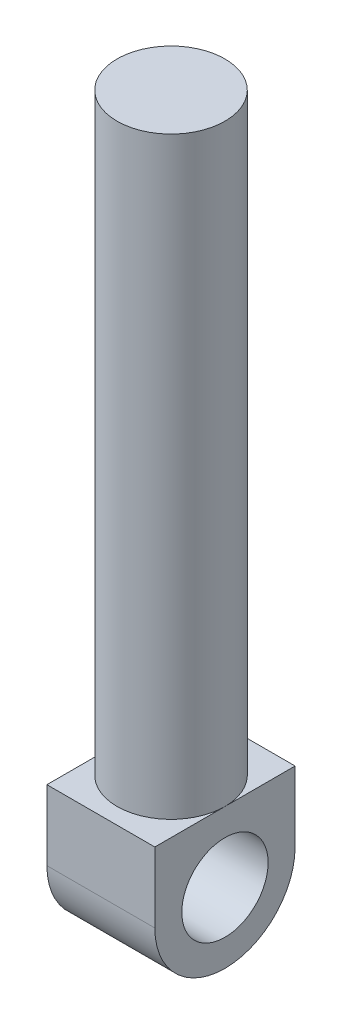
ISO-10303-21;
HEADER;
FILE_DESCRIPTION(('STEP AP214'),'2;1');
FILE_NAME('part.step','',(''),(''),'','','');
FILE_SCHEMA(('AUTOMOTIVE_DESIGN { 1 0 10303 214 1 1 1 1 }'));
ENDSEC;
DATA;
#1=APPLICATION_CONTEXT('core data for automotive mechanical design processes');
#2=APPLICATION_PROTOCOL_DEFINITION('international standard','automotive_design',2000,#1);
#3=PRODUCT_CONTEXT('',#1,'mechanical');
#4=PRODUCT('Part','Part','',(#3));
#5=PRODUCT_RELATED_PRODUCT_CATEGORY('part','',(#4));
#6=PRODUCT_DEFINITION_FORMATION('','',#4);
#7=PRODUCT_DEFINITION_CONTEXT('part definition',#1,'design');
#8=PRODUCT_DEFINITION('design','',#6,#7);
#9=PRODUCT_DEFINITION_SHAPE('','',#8);
#10=(LENGTH_UNIT() NAMED_UNIT(*) SI_UNIT(.MILLI.,.METRE.));
#11=(NAMED_UNIT(*) PLANE_ANGLE_UNIT() SI_UNIT($,.RADIAN.));
#12=(NAMED_UNIT(*) SI_UNIT($,.STERADIAN.) SOLID_ANGLE_UNIT());
#13=UNCERTAINTY_MEASURE_WITH_UNIT(LENGTH_MEASURE(1.E-05),#10,'distance_accuracy_value','');
#14=(GEOMETRIC_REPRESENTATION_CONTEXT(3) GLOBAL_UNCERTAINTY_ASSIGNED_CONTEXT((#13)) GLOBAL_UNIT_ASSIGNED_CONTEXT((#10,
#11,#12)) REPRESENTATION_CONTEXT('',''));
#15=CARTESIAN_POINT('',(0.,0.,0.));
#16=DIRECTION('',(0.,0.,1.));
#17=DIRECTION('',(1.,0.,0.));
#18=AXIS2_PLACEMENT_3D('',#15,#16,#17);
#19=CARTESIAN_POINT('',(0.,615.,0.));
#20=DIRECTION('',(0.,-1.,0.));
#21=DIRECTION('',(0.,0.,-1.));
#22=AXIS2_PLACEMENT_3D('',#19,#20,#21);
#23=CYLINDRICAL_SURFACE('',#22,50.);
#24=CARTESIAN_POINT('',(0.,615.,0.));
#25=DIRECTION('',(0.,1.,0.));
#26=DIRECTION('',(0.,0.,1.));
#27=AXIS2_PLACEMENT_3D('',#24,#25,#26);
#28=CIRCLE('',#27,50.);
#29=CARTESIAN_POINT('',(0.,615.,50.));
#30=VERTEX_POINT('',#29);
#31=EDGE_CURVE('E11',#30,#30,#28,.T.);
#32=ORIENTED_EDGE('',*,*,#31,.F.);
#33=EDGE_LOOP('',(#32));
#34=FACE_BOUND('',#33,.T.);
#35=CARTESIAN_POINT('',(0.,65.,0.));
#36=DIRECTION('',(0.,1.,0.));
#37=DIRECTION('',(0.,0.,1.));
#38=AXIS2_PLACEMENT_3D('',#35,#36,#37);
#39=CIRCLE('',#38,50.);
#40=CARTESIAN_POINT('',(0.,65.,50.));
#41=VERTEX_POINT('',#40);
#42=EDGE_CURVE('E52',#41,#41,#39,.T.);
#43=ORIENTED_EDGE('',*,*,#42,.T.);
#44=EDGE_LOOP('',(#43));
#45=FACE_BOUND('',#44,.T.);
#46=ADVANCED_FACE('F49',(#34,#45),#23,.T.);
#47=CARTESIAN_POINT('',(0.,615.,0.));
#48=DIRECTION('',(0.,1.,0.));
#49=DIRECTION('',(0.,0.,1.));
#50=AXIS2_PLACEMENT_3D('',#47,#48,#49);
#51=PLANE('',#50);
#52=ORIENTED_EDGE('',*,*,#31,.T.);
#53=EDGE_LOOP('',(#52));
#54=FACE_BOUND('',#53,.T.);
#55=ADVANCED_FACE('F64',(#54),#51,.T.);
#56=CARTESIAN_POINT('',(0.,65.,0.));
#57=DIRECTION('',(0.,1.,0.));
#58=DIRECTION('',(0.,0.,1.));
#59=AXIS2_PLACEMENT_3D('',#56,#57,#58);
#60=PLANE('',#59);
#61=ORIENTED_EDGE('',*,*,#42,.F.);
#62=EDGE_LOOP('',(#61));
#63=FACE_BOUND('',#62,.T.);
#64=ADVANCED_FACE('F62',(#63),#60,.F.);
#65=CLOSED_SHELL('',(#46,#55,#64));
#66=MANIFOLD_SOLID_BREP('B2',#65);
#67=CARTESIAN_POINT('',(50.,65.,0.));
#68=DIRECTION('',(0.,1.,0.));
#69=DIRECTION('',(0.,0.,1.));
#70=AXIS2_PLACEMENT_3D('',#67,#68,#69);
#71=PLANE('',#70);
#72=DIRECTION('',(0.,0.,-1.));
#73=VECTOR('',#72,1.);
#74=CARTESIAN_POINT('',(-50.,65.,0.));
#75=LINE('',#74,#73);
#76=CARTESIAN_POINT('',(-50.,65.,65.));
#77=VERTEX_POINT('',#76);
#78=CARTESIAN_POINT('',(-50.,65.,-65.));
#79=VERTEX_POINT('',#78);
#80=EDGE_CURVE('E164',#77,#79,#75,.T.);
#81=ORIENTED_EDGE('',*,*,#80,.F.);
#82=DIRECTION('',(-1.,0.,0.));
#83=VECTOR('',#82,1.);
#84=CARTESIAN_POINT('',(50.,65.,65.));
#85=LINE('',#84,#83);
#86=CARTESIAN_POINT('',(50.,65.,65.));
#87=VERTEX_POINT('',#86);
#88=EDGE_CURVE('E47',#87,#77,#85,.T.);
#89=ORIENTED_EDGE('',*,*,#88,.F.);
#90=DIRECTION('',(0.,0.,-1.));
#91=VECTOR('',#90,1.);
#92=CARTESIAN_POINT('',(50.,65.,0.));
#93=LINE('',#92,#91);
#94=CARTESIAN_POINT('',(50.,65.,-65.));
#95=VERTEX_POINT('',#94);
#96=EDGE_CURVE('E155',#87,#95,#93,.T.);
#97=ORIENTED_EDGE('',*,*,#96,.T.);
#98=DIRECTION('',(-1.,0.,0.));
#99=VECTOR('',#98,1.);
#100=CARTESIAN_POINT('',(50.,65.,-65.));
#101=LINE('',#100,#99);
#102=EDGE_CURVE('E112',#95,#79,#101,.T.);
#103=ORIENTED_EDGE('',*,*,#102,.T.);
#104=EDGE_LOOP('',(#81,#89,#97,#103));
#105=FACE_BOUND('',#104,.T.);
#106=ADVANCED_FACE('F96',(#105),#71,.T.);
#107=CARTESIAN_POINT('',(50.,0.,65.));
#108=DIRECTION('',(0.,0.,1.));
#109=DIRECTION('',(0.,-1.,0.));
#110=AXIS2_PLACEMENT_3D('',#107,#108,#109);
#111=PLANE('',#110);
#112=DIRECTION('',(0.,1.,0.));
#113=VECTOR('',#112,1.);
#114=CARTESIAN_POINT('',(-50.,0.,65.));
#115=LINE('',#114,#113);
#116=CARTESIAN_POINT('',(-50.,0.,65.));
#117=VERTEX_POINT('',#116);
#118=EDGE_CURVE('E144',#117,#77,#115,.T.);
#119=ORIENTED_EDGE('',*,*,#118,.F.);
#120=DIRECTION('',(-1.,0.,0.));
#121=VECTOR('',#120,1.);
#122=CARTESIAN_POINT('',(50.,0.,65.));
#123=LINE('',#122,#121);
#124=CARTESIAN_POINT('',(50.,0.,65.));
#125=VERTEX_POINT('',#124);
#126=EDGE_CURVE('E104',#125,#117,#123,.T.);
#127=ORIENTED_EDGE('',*,*,#126,.F.);
#128=DIRECTION('',(0.,1.,0.));
#129=VECTOR('',#128,1.);
#130=CARTESIAN_POINT('',(50.,0.,65.));
#131=LINE('',#130,#129);
#132=EDGE_CURVE('E142',#125,#87,#131,.T.);
#133=ORIENTED_EDGE('',*,*,#132,.T.);
#134=ORIENTED_EDGE('',*,*,#88,.T.);
#135=EDGE_LOOP('',(#119,#127,#133,#134));
#136=FACE_BOUND('',#135,.T.);
#137=ADVANCED_FACE('F140',(#136),#111,.T.);
#138=CARTESIAN_POINT('',(50.,0.,0.));
#139=DIRECTION('',(-1.,0.,0.));
#140=DIRECTION('',(0.,0.,1.));
#141=AXIS2_PLACEMENT_3D('',#138,#139,#140);
#142=CYLINDRICAL_SURFACE('',#141,65.);
#143=CARTESIAN_POINT('',(-50.,0.,0.));
#144=DIRECTION('',(1.,0.,0.));
#145=DIRECTION('',(0.,0.,-1.));
#146=AXIS2_PLACEMENT_3D('',#143,#144,#145);
#147=CIRCLE('',#146,65.);
#148=CARTESIAN_POINT('',(-50.,0.,-65.));
#149=VERTEX_POINT('',#148);
#150=EDGE_CURVE('E167',#117,#149,#147,.T.);
#151=ORIENTED_EDGE('',*,*,#150,.T.);
#152=DIRECTION('',(-1.,0.,0.));
#153=VECTOR('',#152,1.);
#154=CARTESIAN_POINT('',(50.,0.,-65.));
#155=LINE('',#154,#153);
#156=CARTESIAN_POINT('',(50.,0.,-65.));
#157=VERTEX_POINT('',#156);
#158=EDGE_CURVE('E126',#157,#149,#155,.T.);
#159=ORIENTED_EDGE('',*,*,#158,.F.);
#160=CARTESIAN_POINT('',(50.,0.,0.));
#161=DIRECTION('',(1.,0.,0.));
#162=DIRECTION('',(0.,0.,-1.));
#163=AXIS2_PLACEMENT_3D('',#160,#161,#162);
#164=CIRCLE('',#163,65.);
#165=EDGE_CURVE('E147',#125,#157,#164,.T.);
#166=ORIENTED_EDGE('',*,*,#165,.F.);
#167=ORIENTED_EDGE('',*,*,#126,.T.);
#168=EDGE_LOOP('',(#151,#159,#166,#167));
#169=FACE_BOUND('',#168,.T.);
#170=ADVANCED_FACE('F148',(#169),#142,.T.);
#171=CARTESIAN_POINT('',(50.,0.,-65.));
#172=DIRECTION('',(0.,0.,-1.));
#173=DIRECTION('',(0.,1.,0.));
#174=AXIS2_PLACEMENT_3D('',#171,#172,#173);
#175=PLANE('',#174);
#176=DIRECTION('',(0.,-1.,0.));
#177=VECTOR('',#176,1.);
#178=CARTESIAN_POINT('',(-50.,0.,-65.));
#179=LINE('',#178,#177);
#180=EDGE_CURVE('E169',#79,#149,#179,.T.);
#181=ORIENTED_EDGE('',*,*,#180,.F.);
#182=ORIENTED_EDGE('',*,*,#102,.F.);
#183=DIRECTION('',(0.,-1.,0.));
#184=VECTOR('',#183,1.);
#185=CARTESIAN_POINT('',(50.,0.,-65.));
#186=LINE('',#185,#184);
#187=EDGE_CURVE('E151',#95,#157,#186,.T.);
#188=ORIENTED_EDGE('',*,*,#187,.T.);
#189=ORIENTED_EDGE('',*,*,#158,.T.);
#190=EDGE_LOOP('',(#181,#182,#188,#189));
#191=FACE_BOUND('',#190,.T.);
#192=ADVANCED_FACE('F181',(#191),#175,.T.);
#193=CARTESIAN_POINT('',(50.,0.,0.));
#194=DIRECTION('',(-1.,0.,0.));
#195=DIRECTION('',(0.,0.,1.));
#196=AXIS2_PLACEMENT_3D('',#193,#194,#195);
#197=CYLINDRICAL_SURFACE('',#196,40.);
#198=CARTESIAN_POINT('',(50.,0.,0.));
#199=DIRECTION('',(1.,0.,0.));
#200=DIRECTION('',(0.,0.,-1.));
#201=AXIS2_PLACEMENT_3D('',#198,#199,#200);
#202=CIRCLE('',#201,40.);
#203=CARTESIAN_POINT('',(50.,0.,-40.));
#204=VERTEX_POINT('',#203);
#205=EDGE_CURVE('E161',#204,#204,#202,.T.);
#206=ORIENTED_EDGE('',*,*,#205,.T.);
#207=EDGE_LOOP('',(#206));
#208=FACE_BOUND('',#207,.T.);
#209=CARTESIAN_POINT('',(-50.,0.,0.));
#210=DIRECTION('',(1.,0.,0.));
#211=DIRECTION('',(0.,0.,-1.));
#212=AXIS2_PLACEMENT_3D('',#209,#210,#211);
#213=CIRCLE('',#212,40.);
#214=CARTESIAN_POINT('',(-50.,0.,-40.));
#215=VERTEX_POINT('',#214);
#216=EDGE_CURVE('E157',#215,#215,#213,.T.);
#217=ORIENTED_EDGE('',*,*,#216,.F.);
#218=EDGE_LOOP('',(#217));
#219=FACE_BOUND('',#218,.T.);
#220=ADVANCED_FACE('F179',(#208,#219),#197,.F.);
#221=CARTESIAN_POINT('',(50.,0.,0.));
#222=DIRECTION('',(1.,0.,0.));
#223=DIRECTION('',(0.,0.,-1.));
#224=AXIS2_PLACEMENT_3D('',#221,#222,#223);
#225=PLANE('',#224);
#226=ORIENTED_EDGE('',*,*,#96,.F.);
#227=ORIENTED_EDGE('',*,*,#132,.F.);
#228=ORIENTED_EDGE('',*,*,#165,.T.);
#229=ORIENTED_EDGE('',*,*,#187,.F.);
#230=EDGE_LOOP('',(#226,#227,#228,#229));
#231=FACE_BOUND('',#230,.T.);
#232=ORIENTED_EDGE('',*,*,#205,.F.);
#233=EDGE_LOOP('',(#232));
#234=FACE_BOUND('',#233,.T.);
#235=ADVANCED_FACE('F153',(#231,#234),#225,.T.);
#236=CARTESIAN_POINT('',(-50.,0.,0.));
#237=DIRECTION('',(1.,0.,0.));
#238=DIRECTION('',(0.,0.,-1.));
#239=AXIS2_PLACEMENT_3D('',#236,#237,#238);
#240=PLANE('',#239);
#241=ORIENTED_EDGE('',*,*,#80,.T.);
#242=ORIENTED_EDGE('',*,*,#180,.T.);
#243=ORIENTED_EDGE('',*,*,#150,.F.);
#244=ORIENTED_EDGE('',*,*,#118,.T.);
#245=EDGE_LOOP('',(#241,#242,#243,#244));
#246=FACE_BOUND('',#245,.T.);
#247=ORIENTED_EDGE('',*,*,#216,.T.);
#248=EDGE_LOOP('',(#247));
#249=FACE_BOUND('',#248,.T.);
#250=ADVANCED_FACE('F177',(#246,#249),#240,.F.);
#251=CLOSED_SHELL('',(#106,#137,#170,#192,#220,#235,#250));
#252=MANIFOLD_SOLID_BREP('B6',#251);
#253=ADVANCED_BREP_SHAPE_REPRESENTATION('',(#18,#66,#252),#14);
#254=SHAPE_DEFINITION_REPRESENTATION(#9,#253);
ENDSEC;
END-ISO-10303-21;
